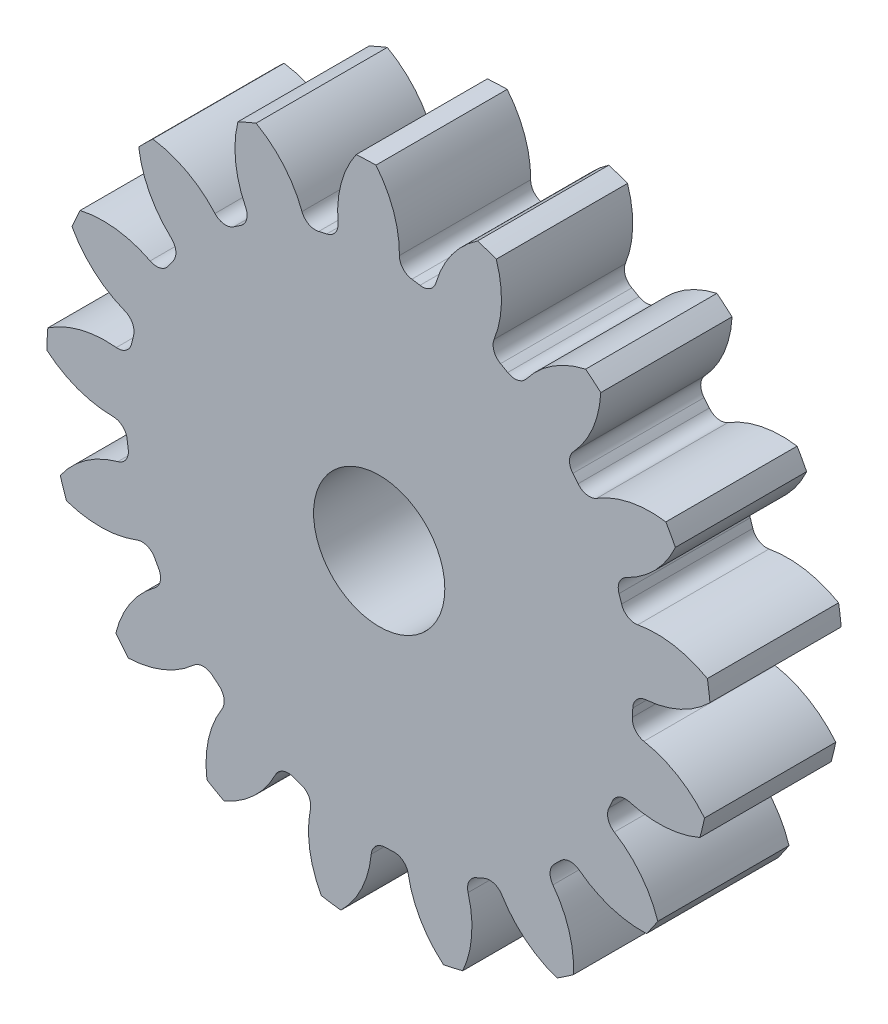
from build123d import *

# Parameters (mm, degrees)
SKETCH3_R         = 321.733333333
GEARBODY_DEPTH    = 127
TOOTHCUT_DEPTH    = 473.391443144
CIRPATTERN1_COUNT = 17
BOREDIA_R         = 63.5
BORE_DEPTH        = 12700


with BuildPart() as part:
    # Sketch3 → gearBody (new body)
    with BuildSketch(Plane.XY):
        Circle(SKETCH3_R)
    extrude(amount=GEARBODY_DEPTH)

    # Sketch2 → toothCut (cut, through all)
    with BuildSketch(Plane.XY):
        with BuildLine():
            ThreePointArc((244.946910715, -16.959619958), (245.190468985, -12.971187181), (245.369088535, -8.979318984))
            ThreePointArc((245.369088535, -8.979318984), (249.180660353, 0.041888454), (258.021663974, 4.254597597))
            ThreePointArc((258.021663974, 4.254597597), (292.646248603, 13.556927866), (321.733333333, 34.517288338))
            ThreePointArc((321.733333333, 34.517288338), (323.127787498, -17.094265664), (316.295597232, -68.270609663))
            ThreePointArc((316.295597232, -68.270609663), (289.582389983, -44.358274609), (256.132556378, -31.454637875))
            ThreePointArc((256.132556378, -31.454637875), (247.785382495, -26.332631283), (244.946910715, -16.959619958))
        make_face()
    toothcut = extrude(amount=TOOTHCUT_DEPTH, mode=Mode.SUBTRACT)

    # CirPattern1: toothCut ×17 about axis
    cirpattern1_axis = Axis((0, 0, 0), (0, 0, 1))
    for i in range(1, CIRPATTERN1_COUNT):
        add(toothcut.rotate(cirpattern1_axis, i * 360 / CIRPATTERN1_COUNT), mode=Mode.SUBTRACT)

    # boreDia → bore (cut, symmetric)
    with BuildSketch(Plane.XY):
        Circle(BOREDIA_R)
    extrude(amount=BORE_DEPTH, both=True, mode=Mode.SUBTRACT)


solid = part.part
